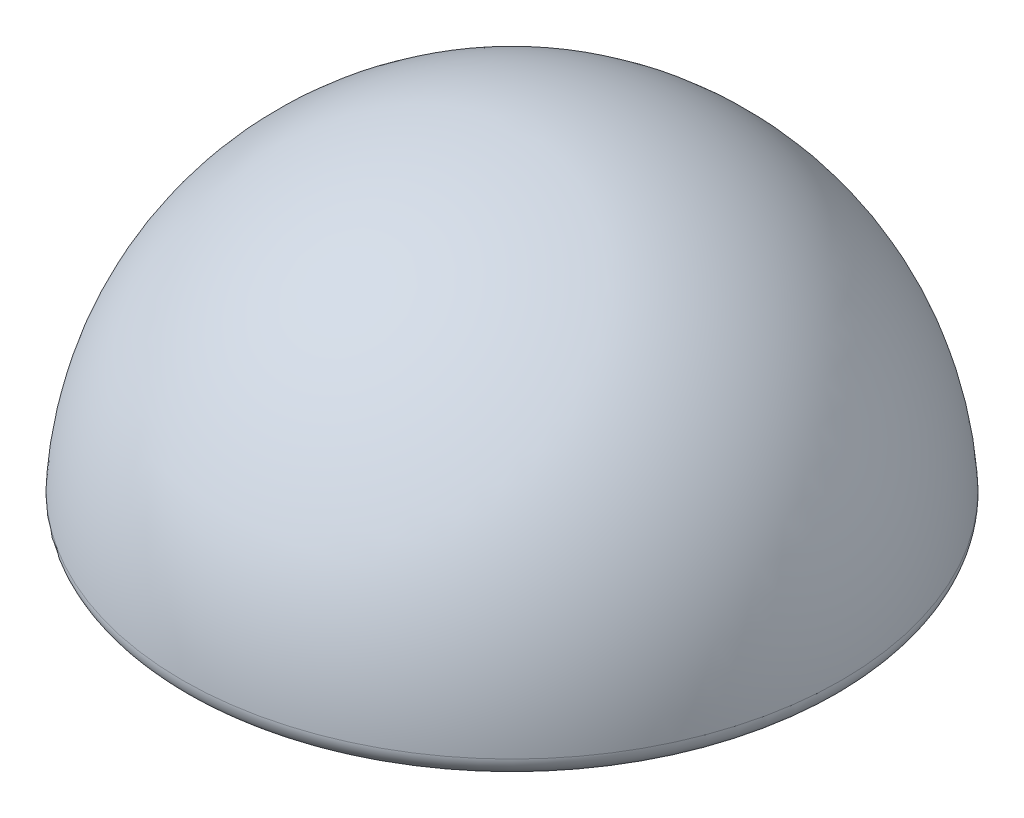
from build123d import *

# Parameters (mm, degrees)
SKETCH2_R          = 12.25
CUT_EXTRUDE1_DEPTH = 16
FILLET1_R          = 2


with BuildPart() as part:
    # Sketch1 → Revolve1 (revolve)
    with BuildSketch(Plane.XY):
        with BuildLine():
            Line((0, 0), (0, 35))
            ThreePointArc((0, 35), (24.748737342, 24.748737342), (35, 0))
            Line((35, 0), (0, 0))
        make_face()
    revolve(axis=Axis((0, 0, 0), (0, 1, 0)))

    # Sketch2 → Cut-Extrude1 (cut)
    with BuildSketch(Plane.XZ):
        with Locations(Location((0, 0, 0), (0, 0, 270))):
            Circle(SKETCH2_R)
    extrude(amount=-CUT_EXTRUDE1_DEPTH, mode=Mode.SUBTRACT)

    # Fillet1
    fillet1_edges = [part.edges().sort_by_distance(p)[0] for p in [
        (-35, 0, 0),
    ]]
    fillet(fillet1_edges, radius=FILLET1_R)


solid = part.part
